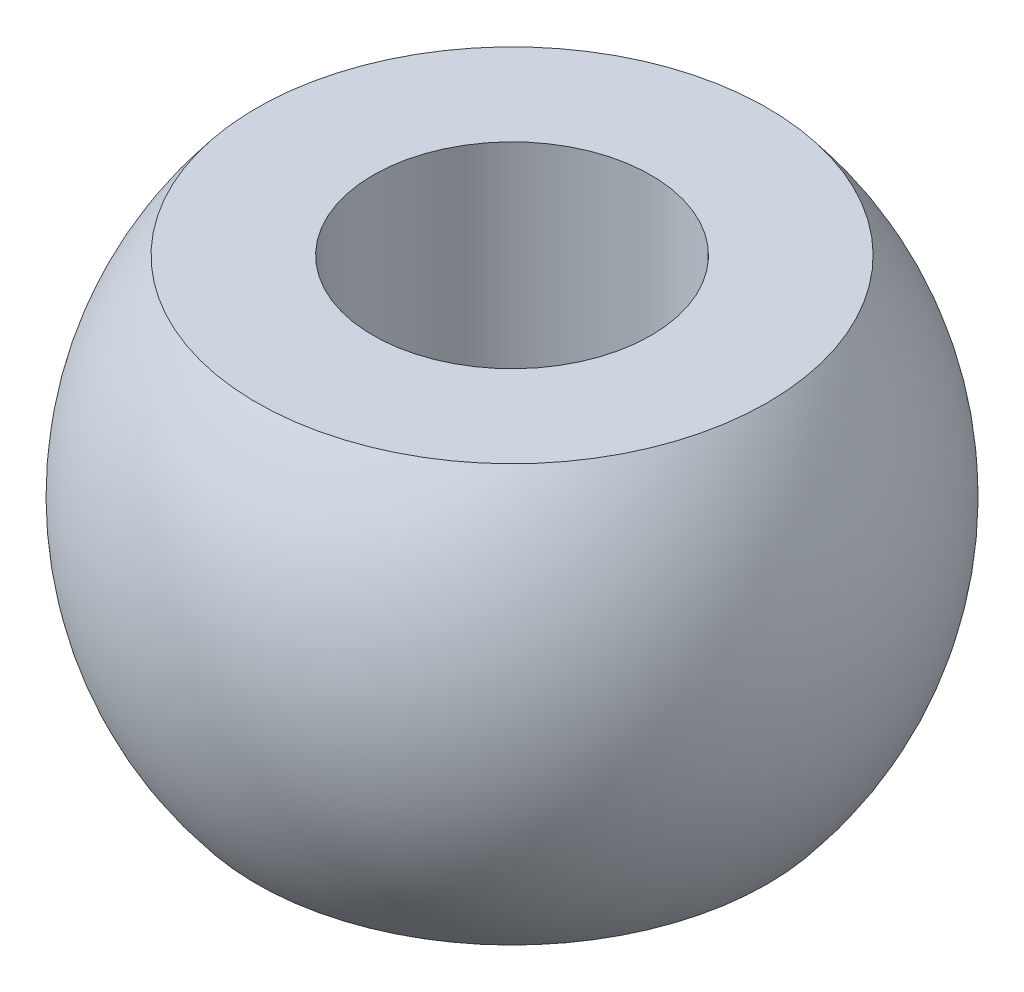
from build123d import *


with BuildPart() as part:
    # Sketch1 → Revolve1 (revolve)
    with BuildSketch(Plane.XY, mode=Mode.PRIVATE) as revolve1_sk:
        with BuildLine():
            Line((3.175, 4.7625), (3.175, -4.7625))
            Line((3.175, -4.7625), (5.834043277, -4.7625))
            ThreePointArc((5.834043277, -4.7625), (7.5311, 0), (5.834043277, 4.7625))
            Line((5.834043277, 4.7625), (3.175, 4.7625))
        make_face()
    revolve(revolve1_sk.sketch.rotate(Axis((0, 21.50669344, 0), (0, -1, 0)), 180), axis=Axis((0, 21.50669344, 0), (0, -1, 0)))


solid = part.part
